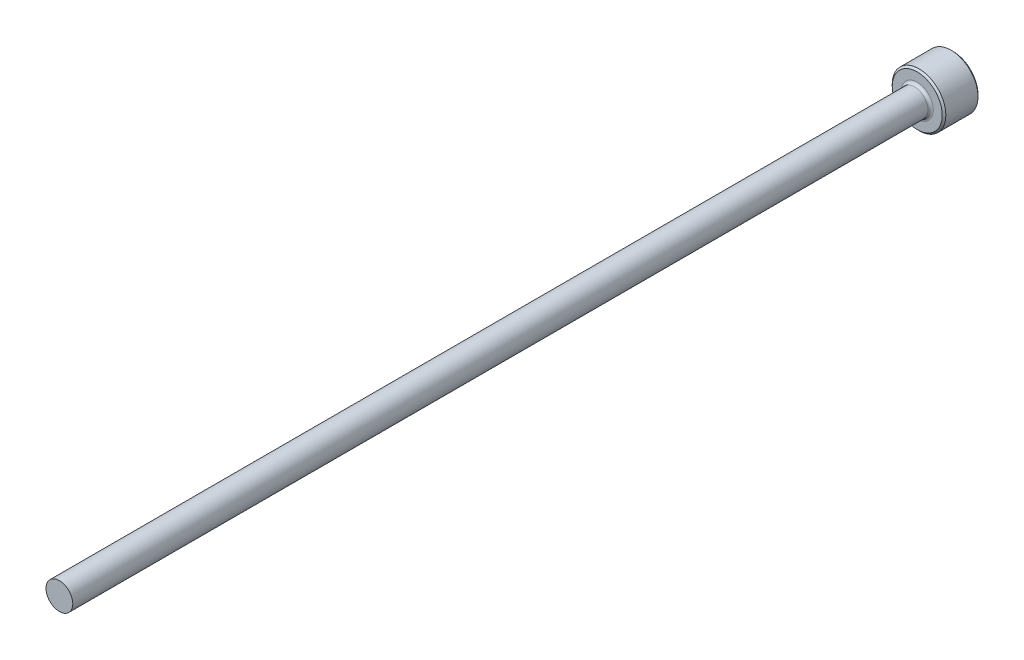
ISO-10303-21;
HEADER;
FILE_DESCRIPTION(('STEP AP214'),'2;1');
FILE_NAME('part.step','',(''),(''),'','','');
FILE_SCHEMA(('AUTOMOTIVE_DESIGN { 1 0 10303 214 1 1 1 1 }'));
ENDSEC;
DATA;
#1=APPLICATION_CONTEXT('core data for automotive mechanical design processes');
#2=APPLICATION_PROTOCOL_DEFINITION('international standard','automotive_design',2000,#1);
#3=PRODUCT_CONTEXT('',#1,'mechanical');
#4=PRODUCT('Part','Part','',(#3));
#5=PRODUCT_RELATED_PRODUCT_CATEGORY('part','',(#4));
#6=PRODUCT_DEFINITION_FORMATION('','',#4);
#7=PRODUCT_DEFINITION_CONTEXT('part definition',#1,'design');
#8=PRODUCT_DEFINITION('design','',#6,#7);
#9=PRODUCT_DEFINITION_SHAPE('','',#8);
#10=(LENGTH_UNIT() NAMED_UNIT(*) SI_UNIT(.MILLI.,.METRE.));
#11=(NAMED_UNIT(*) PLANE_ANGLE_UNIT() SI_UNIT($,.RADIAN.));
#12=(NAMED_UNIT(*) SI_UNIT($,.STERADIAN.) SOLID_ANGLE_UNIT());
#13=UNCERTAINTY_MEASURE_WITH_UNIT(LENGTH_MEASURE(1.E-05),#10,'distance_accuracy_value','');
#14=(GEOMETRIC_REPRESENTATION_CONTEXT(3) GLOBAL_UNCERTAINTY_ASSIGNED_CONTEXT((#13)) GLOBAL_UNIT_ASSIGNED_CONTEXT((#10,
#11,#12)) REPRESENTATION_CONTEXT('',''));
#15=CARTESIAN_POINT('',(0.,0.,0.));
#16=DIRECTION('',(0.,0.,1.));
#17=DIRECTION('',(1.,0.,0.));
#18=AXIS2_PLACEMENT_3D('',#15,#16,#17);
#19=CARTESIAN_POINT('',(0.,1.49999999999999,100.));
#20=DIRECTION('',(0.,0.,-1.));
#21=DIRECTION('',(-1.,0.,0.));
#22=AXIS2_PLACEMENT_3D('',#19,#20,#21);
#23=PLANE('',#22);
#24=CARTESIAN_POINT('',(0.,0.,100.));
#25=DIRECTION('',(0.,0.,1.));
#26=DIRECTION('',(1.,0.,0.));
#27=AXIS2_PLACEMENT_3D('',#24,#25,#26);
#28=CIRCLE('',#27,1.49999999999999);
#29=CARTESIAN_POINT('',(1.49999999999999,0.,100.));
#30=VERTEX_POINT('',#29);
#31=EDGE_CURVE('E50',#30,#30,#28,.T.);
#32=ORIENTED_EDGE('',*,*,#31,.T.);
#33=EDGE_LOOP('',(#32));
#34=FACE_BOUND('',#33,.T.);
#35=ADVANCED_FACE('F30',(#34),#23,.F.);
#36=CARTESIAN_POINT('',(0.,0.,109.050628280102));
#37=DIRECTION('',(0.,0.,1.));
#38=DIRECTION('',(1.,0.,0.));
#39=AXIS2_PLACEMENT_3D('',#36,#37,#38);
#40=CYLINDRICAL_SURFACE('',#39,1.49999999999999);
#41=ORIENTED_EDGE('',*,*,#31,.F.);
#42=EDGE_LOOP('',(#41));
#43=FACE_BOUND('',#42,.T.);
#44=CARTESIAN_POINT('',(0.,0.,4.3));
#45=DIRECTION('',(0.,0.,1.));
#46=DIRECTION('',(1.,0.,0.));
#47=AXIS2_PLACEMENT_3D('',#44,#45,#46);
#48=CIRCLE('',#47,1.5);
#49=CARTESIAN_POINT('',(1.5,0.,4.3));
#50=VERTEX_POINT('',#49);
#51=EDGE_CURVE('E53',#50,#50,#48,.T.);
#52=ORIENTED_EDGE('',*,*,#51,.T.);
#53=EDGE_LOOP('',(#52));
#54=FACE_BOUND('',#53,.T.);
#55=ADVANCED_FACE('F73',(#43,#54),#40,.T.);
#56=CARTESIAN_POINT('',(0.,0.,4.3));
#57=DIRECTION('',(0.,0.,1.));
#58=DIRECTION('',(1.,0.,0.));
#59=AXIS2_PLACEMENT_3D('',#56,#57,#58);
#60=TOROIDAL_SURFACE('',#59,1.8,0.3);
#61=ORIENTED_EDGE('',*,*,#51,.F.);
#62=EDGE_LOOP('',(#61));
#63=FACE_BOUND('',#62,.T.);
#64=CARTESIAN_POINT('',(0.,0.,4.));
#65=DIRECTION('',(0.,0.,1.));
#66=DIRECTION('',(1.,0.,0.));
#67=AXIS2_PLACEMENT_3D('',#64,#65,#66);
#68=CIRCLE('',#67,1.8);
#69=CARTESIAN_POINT('',(1.8,0.,4.));
#70=VERTEX_POINT('',#69);
#71=EDGE_CURVE('E56',#70,#70,#68,.T.);
#72=ORIENTED_EDGE('',*,*,#71,.T.);
#73=EDGE_LOOP('',(#72));
#74=FACE_BOUND('',#73,.T.);
#75=ADVANCED_FACE('F60',(#63,#74),#60,.F.);
#76=CARTESIAN_POINT('',(0.,3.,4.));
#77=DIRECTION('',(0.,0.,-1.));
#78=DIRECTION('',(-1.,0.,0.));
#79=AXIS2_PLACEMENT_3D('',#76,#77,#78);
#80=PLANE('',#79);
#81=CARTESIAN_POINT('',(0.,0.,4.));
#82=DIRECTION('',(0.,0.,-1.));
#83=DIRECTION('',(-1.,0.,0.));
#84=AXIS2_PLACEMENT_3D('',#81,#82,#83);
#85=CIRCLE('',#84,2.8);
#86=CARTESIAN_POINT('',(-2.8,0.,4.));
#87=VERTEX_POINT('',#86);
#88=EDGE_CURVE('E10',#87,#87,#85,.F.);
#89=ORIENTED_EDGE('',*,*,#88,.T.);
#90=EDGE_LOOP('',(#89));
#91=FACE_BOUND('',#90,.T.);
#92=ORIENTED_EDGE('',*,*,#71,.F.);
#93=EDGE_LOOP('',(#92));
#94=FACE_BOUND('',#93,.T.);
#95=ADVANCED_FACE('F62',(#91,#94),#80,.F.);
#96=CARTESIAN_POINT('',(0.,0.,109.050628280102));
#97=DIRECTION('',(0.,0.,1.));
#98=DIRECTION('',(1.,0.,0.));
#99=AXIS2_PLACEMENT_3D('',#96,#97,#98);
#100=CYLINDRICAL_SURFACE('',#99,3.);
#101=CARTESIAN_POINT('',(0.,0.,0.200000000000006));
#102=DIRECTION('',(0.,0.,1.));
#103=DIRECTION('',(1.,0.,0.));
#104=AXIS2_PLACEMENT_3D('',#101,#102,#103);
#105=CIRCLE('',#104,3.);
#106=CARTESIAN_POINT('',(3.,0.,0.200000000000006));
#107=VERTEX_POINT('',#106);
#108=EDGE_CURVE('E41',#107,#107,#105,.T.);
#109=ORIENTED_EDGE('',*,*,#108,.T.);
#110=EDGE_LOOP('',(#109));
#111=FACE_BOUND('',#110,.T.);
#112=CARTESIAN_POINT('',(0.,0.,3.8));
#113=DIRECTION('',(0.,0.,-1.));
#114=DIRECTION('',(-1.,0.,0.));
#115=AXIS2_PLACEMENT_3D('',#112,#113,#114);
#116=CIRCLE('',#115,3.);
#117=CARTESIAN_POINT('',(-3.,0.,3.8));
#118=VERTEX_POINT('',#117);
#119=EDGE_CURVE('E45',#118,#118,#116,.T.);
#120=ORIENTED_EDGE('',*,*,#119,.T.);
#121=EDGE_LOOP('',(#120));
#122=FACE_BOUND('',#121,.T.);
#123=ADVANCED_FACE('F64',(#111,#122),#100,.T.);
#124=CARTESIAN_POINT('',(0.,0.,0.));
#125=DIRECTION('',(0.,0.,1.));
#126=DIRECTION('',(1.,0.,0.));
#127=AXIS2_PLACEMENT_3D('',#124,#125,#126);
#128=PLANE('',#127);
#129=CARTESIAN_POINT('',(0.,0.,0.));
#130=DIRECTION('',(0.,0.,1.));
#131=DIRECTION('',(1.,0.,0.));
#132=AXIS2_PLACEMENT_3D('',#129,#130,#131);
#133=CIRCLE('',#132,2.8);
#134=CARTESIAN_POINT('',(2.8,0.,0.));
#135=VERTEX_POINT('',#134);
#136=EDGE_CURVE('E37',#135,#135,#133,.F.);
#137=ORIENTED_EDGE('',*,*,#136,.T.);
#138=EDGE_LOOP('',(#137));
#139=FACE_BOUND('',#138,.T.);
#140=ADVANCED_FACE('F70',(#139),#128,.F.);
#141=CARTESIAN_POINT('',(0.,0.,0.200000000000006));
#142=DIRECTION('',(0.,0.,1.));
#143=DIRECTION('',(1.,0.,0.));
#144=AXIS2_PLACEMENT_3D('',#141,#142,#143);
#145=CONICAL_SURFACE('',#144,3.,0.785398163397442);
#146=ORIENTED_EDGE('',*,*,#136,.F.);
#147=EDGE_LOOP('',(#146));
#148=FACE_BOUND('',#147,.T.);
#149=ORIENTED_EDGE('',*,*,#108,.F.);
#150=EDGE_LOOP('',(#149));
#151=FACE_BOUND('',#150,.T.);
#152=ADVANCED_FACE('F84',(#148,#151),#145,.T.);
#153=CARTESIAN_POINT('',(0.,0.,4.));
#154=DIRECTION('',(0.,0.,-1.));
#155=DIRECTION('',(-1.,0.,0.));
#156=AXIS2_PLACEMENT_3D('',#153,#154,#155);
#157=CONICAL_SURFACE('',#156,2.8,0.785398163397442);
#158=ORIENTED_EDGE('',*,*,#119,.F.);
#159=EDGE_LOOP('',(#158));
#160=FACE_BOUND('',#159,.T.);
#161=ORIENTED_EDGE('',*,*,#88,.F.);
#162=EDGE_LOOP('',(#161));
#163=FACE_BOUND('',#162,.T.);
#164=ADVANCED_FACE('F32',(#160,#163),#157,.T.);
#165=CLOSED_SHELL('',(#35,#55,#75,#95,#123,#140,#152,#164));
#166=MANIFOLD_SOLID_BREP('B2',#165);
#167=ADVANCED_BREP_SHAPE_REPRESENTATION('',(#18,#166),#14);
#168=SHAPE_DEFINITION_REPRESENTATION(#9,#167);
ENDSEC;
END-ISO-10303-21;
